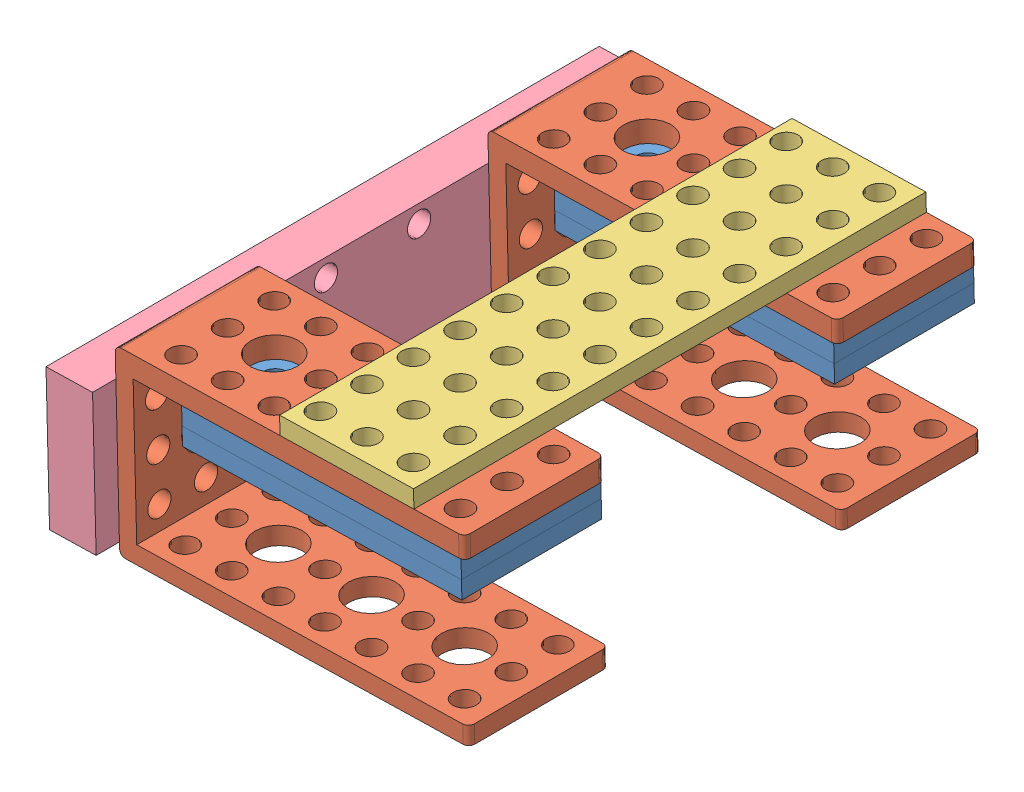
SolidWorks assembly 夹子231.SLDASM, configuration 默认 (file format 10000). Lengths in mm.
Overall size (68.6 35.35 95.04).
10 component instances, 4 part files, 6 mates.
Components (placement in the parent):
- 夹子夹子-1: 夹子夹子.SLDASM [默认] at (13.7216 71.6328 -22.4221) size (60.72 32.46 24.05)
  - 6x3-1: 6x3.SLDPRT [默认] at (-89.5856 -41.0163 78.9159) x (0.999715 0.023893 0.000018) z (0.000018 -0.001543 0.999999) size (48 3 24)
  - 6x3-2: 6x3.SLDPRT [默认] at (-89.6573 -38.0172 78.9205) x (0.999715 0.023893 0.000018) z (0.000018 -0.001543 0.999999) size (48 3 24)
  - 三面长脚铁-1: 三面长脚铁.SLDPRT [Default] at (-98.7995 -35.218 67.9917) x (0.023893 -0.999713 -0.001543) z (0.000018 -0.001543 0.999999) size (31 60 24)
- 夹子夹子-2: 夹子夹子.SLDASM [默认] at (13.7204 71.7316 -86.422) size (60.72 32.46 24.05)
  - 6x3-1: 6x3.SLDPRT [默认] at (-89.5856 -41.0163 78.9159) x (0.999715 0.023893 0.000018) z (0.000018 -0.001543 0.999999) size (48 3 24)
  - 6x3-2: 6x3.SLDPRT [默认] at (-89.6573 -38.0172 78.9205) x (0.999715 0.023893 0.000018) z (0.000018 -0.001543 0.999999) size (48 3 24)
  - 三面长脚铁-1: 三面长脚铁.SLDPRT [Default] at (-98.7995 -35.218 67.9917) x (0.023893 -0.999713 -0.001543) z (0.000018 -0.001543 0.999999) size (31 60 24)
- 3x11-1: 3x11.SLDPRT [默认] at (-69.5333 40.4492 6.1681) x (0.000018 -0.001543 0.999999) z (-0.999715 -0.023893 -0.000018) size (88 3 23)
- 6孔-1: 6孔.SLDPRT [默认] at (-116.7105 21.0777 55.2558) x (-0.000018 0.001543 -0.999999) z (0.023893 -0.999713 -0.001543) size (95 8 24)
Mates (geometry in assembly coordinates):
- 重合3: coincident aligned: circle of 夹子夹子-1/三面长脚铁-1; circle of 3x11-1
- 平行2: parallel anti-aligned: line of 夹子夹子-1/三面长脚铁-1 through (-50.1633 40.8143 69.5758) axis (-0.999715 -0.023893 -0.000018); line of 3x11-1 through (-80.8968 43.0806 69.5798) axis (0.999715 0.023893 0.000018)
- 重合5: coincident aligned: circle of 夹子夹子-2/三面长脚铁-1; circle of 3x11-1
- 平行3: parallel aligned: line of 夹子夹子-2/三面长脚铁-1 through (-108.1484 39.5643 -18.4252) axis (0.000018 -0.001543 0.999999); line of 3x11-1 through (-80.8985 43.2164 -18.4201) axis (0.000018 -0.001543 0.999999)
- 重合7: coincident aligned: circle of 夹子夹子-1/三面长脚铁-1; circle of 6孔-1
- 平行4: parallel anti-aligned: line of 夹子夹子-2/三面长脚铁-1 through (-109.1238 38.5036 5.5732) axis (-0.000018 0.001543 -0.999999); line of 6孔-1 through (-117.0264 34.3553 -21.4331) axis (0.000018 -0.001543 0.999999)
